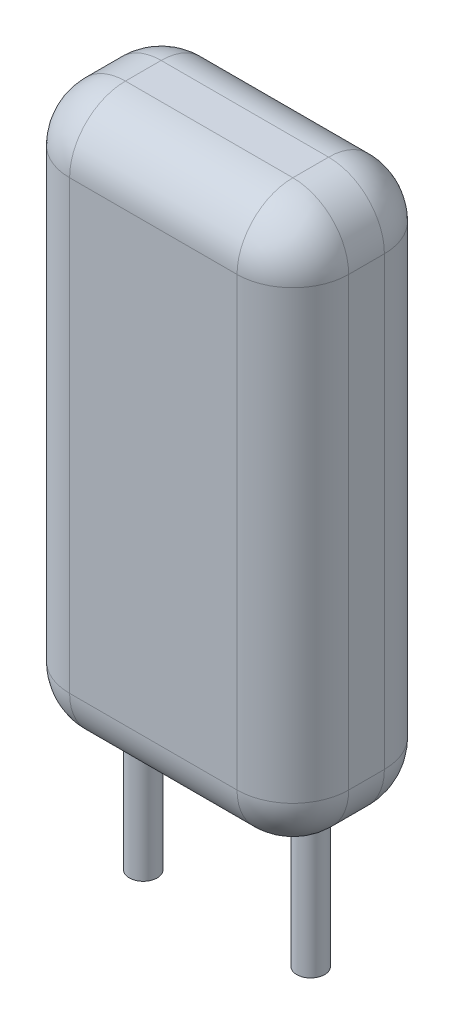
ISO-10303-21;
HEADER;
FILE_DESCRIPTION(('STEP AP214'),'2;1');
FILE_NAME('part.step','',(''),(''),'','','');
FILE_SCHEMA(('AUTOMOTIVE_DESIGN { 1 0 10303 214 1 1 1 1 }'));
ENDSEC;
DATA;
#1=APPLICATION_CONTEXT('core data for automotive mechanical design processes');
#2=APPLICATION_PROTOCOL_DEFINITION('international standard','automotive_design',2000,#1);
#3=PRODUCT_CONTEXT('',#1,'mechanical');
#4=PRODUCT('Part','Part','',(#3));
#5=PRODUCT_RELATED_PRODUCT_CATEGORY('part','',(#4));
#6=PRODUCT_DEFINITION_FORMATION('','',#4);
#7=PRODUCT_DEFINITION_CONTEXT('part definition',#1,'design');
#8=PRODUCT_DEFINITION('design','',#6,#7);
#9=PRODUCT_DEFINITION_SHAPE('','',#8);
#10=(LENGTH_UNIT() NAMED_UNIT(*) SI_UNIT(.MILLI.,.METRE.));
#11=(NAMED_UNIT(*) PLANE_ANGLE_UNIT() SI_UNIT($,.RADIAN.));
#12=(NAMED_UNIT(*) SI_UNIT($,.STERADIAN.) SOLID_ANGLE_UNIT());
#13=UNCERTAINTY_MEASURE_WITH_UNIT(LENGTH_MEASURE(1.E-05),#10,'distance_accuracy_value','');
#14=(GEOMETRIC_REPRESENTATION_CONTEXT(3) GLOBAL_UNCERTAINTY_ASSIGNED_CONTEXT((#13)) GLOBAL_UNIT_ASSIGNED_CONTEXT((#10,
#11,#12)) REPRESENTATION_CONTEXT('',''));
#15=CARTESIAN_POINT('',(0.,0.,0.));
#16=DIRECTION('',(0.,0.,1.));
#17=DIRECTION('',(1.,0.,0.));
#18=AXIS2_PLACEMENT_3D('',#15,#16,#17);
#19=CARTESIAN_POINT('',(5.,0.,1.32));
#20=DIRECTION('',(0.,1.,0.));
#21=DIRECTION('',(0.,0.,1.));
#22=AXIS2_PLACEMENT_3D('',#19,#20,#21);
#23=PLANE('',#22);
#24=CARTESIAN_POINT('',(1.,0.,0.));
#25=DIRECTION('',(0.,-1.,0.));
#26=DIRECTION('',(0.,0.,-1.));
#27=AXIS2_PLACEMENT_3D('',#24,#25,#26);
#28=CIRCLE('',#27,0.25);
#29=CARTESIAN_POINT('',(1.,0.,-0.25));
#30=VERTEX_POINT('',#29);
#31=CARTESIAN_POINT('',(1.,0.,0.25));
#32=VERTEX_POINT('',#31);
#33=EDGE_CURVE('E143',#30,#32,#28,.T.);
#34=ORIENTED_EDGE('',*,*,#33,.F.);
#35=DIRECTION('',(0.,0.,-1.));
#36=VECTOR('',#35,1.);
#37=CARTESIAN_POINT('',(1.,0.,-1.32));
#38=LINE('',#37,#36);
#39=CARTESIAN_POINT('',(1.,0.,-0.32));
#40=VERTEX_POINT('',#39);
#41=EDGE_CURVE('E129',#30,#40,#38,.T.);
#42=ORIENTED_EDGE('',*,*,#41,.T.);
#43=DIRECTION('',(-1.,0.,0.));
#44=VECTOR('',#43,1.);
#45=CARTESIAN_POINT('',(5.,0.,-0.32));
#46=LINE('',#45,#44);
#47=CARTESIAN_POINT('',(4.,0.,-0.32));
#48=VERTEX_POINT('',#47);
#49=EDGE_CURVE('E139',#40,#48,#46,.F.);
#50=ORIENTED_EDGE('',*,*,#49,.T.);
#51=DIRECTION('',(0.,0.,-1.));
#52=VECTOR('',#51,1.);
#53=CARTESIAN_POINT('',(4.,0.,1.32));
#54=LINE('',#53,#52);
#55=CARTESIAN_POINT('',(4.,0.,-0.25));
#56=VERTEX_POINT('',#55);
#57=EDGE_CURVE('E248',#48,#56,#54,.F.);
#58=ORIENTED_EDGE('',*,*,#57,.T.);
#59=CARTESIAN_POINT('',(4.,0.,0.));
#60=DIRECTION('',(0.,-1.,0.));
#61=DIRECTION('',(0.,0.,-1.));
#62=AXIS2_PLACEMENT_3D('',#59,#60,#61);
#63=CIRCLE('',#62,0.25);
#64=CARTESIAN_POINT('',(4.,0.,0.25));
#65=VERTEX_POINT('',#64);
#66=EDGE_CURVE('E156',#65,#56,#63,.T.);
#67=ORIENTED_EDGE('',*,*,#66,.F.);
#68=CARTESIAN_POINT('',(4.,0.,0.32));
#69=VERTEX_POINT('',#68);
#70=EDGE_CURVE('E247',#65,#69,#54,.F.);
#71=ORIENTED_EDGE('',*,*,#70,.T.);
#72=DIRECTION('',(-1.,0.,0.));
#73=VECTOR('',#72,1.);
#74=CARTESIAN_POINT('',(5.,0.,0.32));
#75=LINE('',#74,#73);
#76=CARTESIAN_POINT('',(1.,0.,0.32));
#77=VERTEX_POINT('',#76);
#78=EDGE_CURVE('E245',#69,#77,#75,.T.);
#79=ORIENTED_EDGE('',*,*,#78,.T.);
#80=EDGE_CURVE('E141',#77,#32,#38,.T.);
#81=ORIENTED_EDGE('',*,*,#80,.T.);
#82=EDGE_LOOP('',(#34,#42,#50,#58,#67,#71,#79,#81));
#83=FACE_BOUND('',#82,.T.);
#84=ADVANCED_FACE('F28',(#83),#23,.F.);
#85=CARTESIAN_POINT('',(5.,0.,1.32));
#86=DIRECTION('',(0.,0.,-1.));
#87=DIRECTION('',(-1.,0.,0.));
#88=AXIS2_PLACEMENT_3D('',#85,#86,#87);
#89=PLANE('',#88);
#90=DIRECTION('',(0.,-1.,0.));
#91=VECTOR('',#90,1.);
#92=CARTESIAN_POINT('',(1.,0.,1.32));
#93=LINE('',#92,#91);
#94=CARTESIAN_POINT('',(1.,9.,1.32));
#95=VERTEX_POINT('',#94);
#96=CARTESIAN_POINT('',(1.,1.,1.32));
#97=VERTEX_POINT('',#96);
#98=EDGE_CURVE('E262',#95,#97,#93,.T.);
#99=ORIENTED_EDGE('',*,*,#98,.T.);
#100=DIRECTION('',(-1.,0.,0.));
#101=VECTOR('',#100,1.);
#102=CARTESIAN_POINT('',(5.,1.,1.32));
#103=LINE('',#102,#101);
#104=CARTESIAN_POINT('',(4.,1.,1.32));
#105=VERTEX_POINT('',#104);
#106=EDGE_CURVE('E266',#97,#105,#103,.F.);
#107=ORIENTED_EDGE('',*,*,#106,.T.);
#108=DIRECTION('',(0.,-1.,0.));
#109=VECTOR('',#108,1.);
#110=CARTESIAN_POINT('',(4.,0.,1.32));
#111=LINE('',#110,#109);
#112=CARTESIAN_POINT('',(4.,9.,1.32));
#113=VERTEX_POINT('',#112);
#114=EDGE_CURVE('E264',#105,#113,#111,.F.);
#115=ORIENTED_EDGE('',*,*,#114,.T.);
#116=DIRECTION('',(-1.,0.,0.));
#117=VECTOR('',#116,1.);
#118=CARTESIAN_POINT('',(5.,9.,1.32));
#119=LINE('',#118,#117);
#120=EDGE_CURVE('E260',#113,#95,#119,.T.);
#121=ORIENTED_EDGE('',*,*,#120,.T.);
#122=EDGE_LOOP('',(#99,#107,#115,#121));
#123=FACE_BOUND('',#122,.T.);
#124=ADVANCED_FACE('F30',(#123),#89,.F.);
#125=CARTESIAN_POINT('',(5.,0.,-1.32));
#126=DIRECTION('',(0.,0.,1.));
#127=DIRECTION('',(1.,0.,0.));
#128=AXIS2_PLACEMENT_3D('',#125,#126,#127);
#129=PLANE('',#128);
#130=DIRECTION('',(-1.,0.,0.));
#131=VECTOR('',#130,1.);
#132=CARTESIAN_POINT('',(5.,1.,-1.32));
#133=LINE('',#132,#131);
#134=CARTESIAN_POINT('',(4.,1.,-1.32));
#135=VERTEX_POINT('',#134);
#136=CARTESIAN_POINT('',(1.,1.,-1.32));
#137=VERTEX_POINT('',#136);
#138=EDGE_CURVE('E231',#135,#137,#133,.T.);
#139=ORIENTED_EDGE('',*,*,#138,.T.);
#140=DIRECTION('',(0.,1.,0.));
#141=VECTOR('',#140,1.);
#142=CARTESIAN_POINT('',(1.,10.,-1.32));
#143=LINE('',#142,#141);
#144=CARTESIAN_POINT('',(1.,9.,-1.32));
#145=VERTEX_POINT('',#144);
#146=EDGE_CURVE('E233',#137,#145,#143,.T.);
#147=ORIENTED_EDGE('',*,*,#146,.T.);
#148=DIRECTION('',(-1.,0.,0.));
#149=VECTOR('',#148,1.);
#150=CARTESIAN_POINT('',(5.,9.,-1.32));
#151=LINE('',#150,#149);
#152=CARTESIAN_POINT('',(4.,9.,-1.32));
#153=VERTEX_POINT('',#152);
#154=EDGE_CURVE('E227',#145,#153,#151,.F.);
#155=ORIENTED_EDGE('',*,*,#154,.T.);
#156=DIRECTION('',(0.,1.,0.));
#157=VECTOR('',#156,1.);
#158=CARTESIAN_POINT('',(4.,0.,-1.32));
#159=LINE('',#158,#157);
#160=EDGE_CURVE('E229',#153,#135,#159,.F.);
#161=ORIENTED_EDGE('',*,*,#160,.T.);
#162=EDGE_LOOP('',(#139,#147,#155,#161));
#163=FACE_BOUND('',#162,.T.);
#164=ADVANCED_FACE('F328',(#163),#129,.F.);
#165=CARTESIAN_POINT('',(5.,10.,1.32));
#166=DIRECTION('',(0.,-1.,0.));
#167=DIRECTION('',(0.,0.,-1.));
#168=AXIS2_PLACEMENT_3D('',#165,#166,#167);
#169=PLANE('',#168);
#170=DIRECTION('',(-1.,0.,0.));
#171=VECTOR('',#170,1.);
#172=CARTESIAN_POINT('',(5.,10.,0.32));
#173=LINE('',#172,#171);
#174=CARTESIAN_POINT('',(1.,10.,0.32));
#175=VERTEX_POINT('',#174);
#176=CARTESIAN_POINT('',(4.,10.,0.32));
#177=VERTEX_POINT('',#176);
#178=EDGE_CURVE('E269',#175,#177,#173,.F.);
#179=ORIENTED_EDGE('',*,*,#178,.T.);
#180=DIRECTION('',(0.,0.,1.));
#181=VECTOR('',#180,1.);
#182=CARTESIAN_POINT('',(4.,10.,1.32));
#183=LINE('',#182,#181);
#184=CARTESIAN_POINT('',(4.,10.,-0.32));
#185=VERTEX_POINT('',#184);
#186=EDGE_CURVE('E11',#177,#185,#183,.F.);
#187=ORIENTED_EDGE('',*,*,#186,.T.);
#188=DIRECTION('',(-1.,0.,0.));
#189=VECTOR('',#188,1.);
#190=CARTESIAN_POINT('',(5.,10.,-0.32));
#191=LINE('',#190,#189);
#192=CARTESIAN_POINT('',(1.,10.,-0.32));
#193=VERTEX_POINT('',#192);
#194=EDGE_CURVE('E36',#185,#193,#191,.T.);
#195=ORIENTED_EDGE('',*,*,#194,.T.);
#196=DIRECTION('',(0.,0.,1.));
#197=VECTOR('',#196,1.);
#198=CARTESIAN_POINT('',(1.,10.,1.32));
#199=LINE('',#198,#197);
#200=EDGE_CURVE('E271',#193,#175,#199,.T.);
#201=ORIENTED_EDGE('',*,*,#200,.T.);
#202=EDGE_LOOP('',(#179,#187,#195,#201));
#203=FACE_BOUND('',#202,.T.);
#204=ADVANCED_FACE('F274',(#203),#169,.F.);
#205=CARTESIAN_POINT('',(5.,10.,1.32));
#206=DIRECTION('',(-1.,0.,0.));
#207=DIRECTION('',(0.,0.,1.));
#208=AXIS2_PLACEMENT_3D('',#205,#206,#207);
#209=PLANE('',#208);
#210=DIRECTION('',(0.,-1.,0.));
#211=VECTOR('',#210,1.);
#212=CARTESIAN_POINT('',(5.,10.,0.32));
#213=LINE('',#212,#211);
#214=CARTESIAN_POINT('',(5.,9.,0.32));
#215=VERTEX_POINT('',#214);
#216=CARTESIAN_POINT('',(5.,1.,0.32));
#217=VERTEX_POINT('',#216);
#218=EDGE_CURVE('E253',#215,#217,#213,.T.);
#219=ORIENTED_EDGE('',*,*,#218,.T.);
#220=DIRECTION('',(0.,0.,-1.));
#221=VECTOR('',#220,1.);
#222=CARTESIAN_POINT('',(5.,1.,1.32));
#223=LINE('',#222,#221);
#224=CARTESIAN_POINT('',(5.,1.,-0.32));
#225=VERTEX_POINT('',#224);
#226=EDGE_CURVE('E257',#217,#225,#223,.T.);
#227=ORIENTED_EDGE('',*,*,#226,.T.);
#228=DIRECTION('',(0.,1.,0.));
#229=VECTOR('',#228,1.);
#230=CARTESIAN_POINT('',(5.,10.,-0.32));
#231=LINE('',#230,#229);
#232=CARTESIAN_POINT('',(5.,9.,-0.32));
#233=VERTEX_POINT('',#232);
#234=EDGE_CURVE('E255',#225,#233,#231,.T.);
#235=ORIENTED_EDGE('',*,*,#234,.T.);
#236=DIRECTION('',(0.,0.,1.));
#237=VECTOR('',#236,1.);
#238=CARTESIAN_POINT('',(5.,9.,1.32));
#239=LINE('',#238,#237);
#240=EDGE_CURVE('E251',#233,#215,#239,.T.);
#241=ORIENTED_EDGE('',*,*,#240,.T.);
#242=EDGE_LOOP('',(#219,#227,#235,#241));
#243=FACE_BOUND('',#242,.T.);
#244=ADVANCED_FACE('F352',(#243),#209,.F.);
#245=CARTESIAN_POINT('',(0.,10.,1.32));
#246=DIRECTION('',(-1.,0.,0.));
#247=DIRECTION('',(0.,0.,1.));
#248=AXIS2_PLACEMENT_3D('',#245,#246,#247);
#249=PLANE('',#248);
#250=DIRECTION('',(0.,0.,1.));
#251=VECTOR('',#250,1.);
#252=CARTESIAN_POINT('',(0.,9.,-1.32));
#253=LINE('',#252,#251);
#254=CARTESIAN_POINT('',(0.,9.,0.32));
#255=VERTEX_POINT('',#254);
#256=CARTESIAN_POINT('',(0.,9.,-0.32));
#257=VERTEX_POINT('',#256);
#258=EDGE_CURVE('E238',#255,#257,#253,.F.);
#259=ORIENTED_EDGE('',*,*,#258,.T.);
#260=DIRECTION('',(0.,1.,0.));
#261=VECTOR('',#260,1.);
#262=CARTESIAN_POINT('',(0.,0.,-0.32));
#263=LINE('',#262,#261);
#264=CARTESIAN_POINT('',(0.,1.,-0.32));
#265=VERTEX_POINT('',#264);
#266=EDGE_CURVE('E242',#257,#265,#263,.F.);
#267=ORIENTED_EDGE('',*,*,#266,.T.);
#268=DIRECTION('',(0.,0.,-1.));
#269=VECTOR('',#268,1.);
#270=CARTESIAN_POINT('',(0.,1.,1.32));
#271=LINE('',#270,#269);
#272=CARTESIAN_POINT('',(0.,1.,0.32));
#273=VERTEX_POINT('',#272);
#274=EDGE_CURVE('E240',#265,#273,#271,.F.);
#275=ORIENTED_EDGE('',*,*,#274,.T.);
#276=DIRECTION('',(0.,-1.,0.));
#277=VECTOR('',#276,1.);
#278=CARTESIAN_POINT('',(0.,10.,0.32));
#279=LINE('',#278,#277);
#280=EDGE_CURVE('E236',#273,#255,#279,.F.);
#281=ORIENTED_EDGE('',*,*,#280,.T.);
#282=EDGE_LOOP('',(#259,#267,#275,#281));
#283=FACE_BOUND('',#282,.T.);
#284=ADVANCED_FACE('F296',(#283),#249,.T.);
#285=CARTESIAN_POINT('',(4.,10.,0.32));
#286=DIRECTION('',(0.,-1.,0.));
#287=DIRECTION('',(0.,0.,-1.));
#288=AXIS2_PLACEMENT_3D('',#285,#286,#287);
#289=CYLINDRICAL_SURFACE('',#288,1.);
#290=CARTESIAN_POINT('',(4.,1.,0.32));
#291=DIRECTION('',(0.,-1.,0.));
#292=DIRECTION('',(0.,0.,-1.));
#293=AXIS2_PLACEMENT_3D('',#290,#291,#292);
#294=CIRCLE('',#293,1.);
#295=EDGE_CURVE('E224',#217,#105,#294,.T.);
#296=ORIENTED_EDGE('',*,*,#295,.F.);
#297=ORIENTED_EDGE('',*,*,#218,.F.);
#298=CARTESIAN_POINT('',(4.,9.,0.32));
#299=DIRECTION('',(0.,1.,0.));
#300=DIRECTION('',(0.,0.,1.));
#301=AXIS2_PLACEMENT_3D('',#298,#299,#300);
#302=CIRCLE('',#301,1.);
#303=EDGE_CURVE('E221',#113,#215,#302,.T.);
#304=ORIENTED_EDGE('',*,*,#303,.F.);
#305=ORIENTED_EDGE('',*,*,#114,.F.);
#306=EDGE_LOOP('',(#296,#297,#304,#305));
#307=FACE_BOUND('',#306,.T.);
#308=ADVANCED_FACE('F349',(#307),#289,.T.);
#309=CARTESIAN_POINT('',(4.,1.,0.32));
#310=DIRECTION('',(0.,0.,1.));
#311=DIRECTION('',(1.,0.,0.));
#312=AXIS2_PLACEMENT_3D('',#309,#310,#311);
#313=SPHERICAL_SURFACE('',#312,1.);
#314=CARTESIAN_POINT('',(4.,1.,0.32));
#315=DIRECTION('',(0.,0.,1.));
#316=DIRECTION('',(1.,0.,0.));
#317=AXIS2_PLACEMENT_3D('',#314,#315,#316);
#318=CIRCLE('',#317,1.);
#319=EDGE_CURVE('E216',#217,#69,#318,.F.);
#320=ORIENTED_EDGE('',*,*,#319,.F.);
#321=ORIENTED_EDGE('',*,*,#295,.T.);
#322=CARTESIAN_POINT('',(4.,1.,0.32));
#323=DIRECTION('',(1.,0.,0.));
#324=DIRECTION('',(0.,0.,-1.));
#325=AXIS2_PLACEMENT_3D('',#322,#323,#324);
#326=CIRCLE('',#325,1.);
#327=EDGE_CURVE('E219',#69,#105,#326,.F.);
#328=ORIENTED_EDGE('',*,*,#327,.F.);
#329=EDGE_LOOP('',(#320,#321,#328));
#330=FACE_BOUND('',#329,.T.);
#331=ADVANCED_FACE('F383',(#330),#313,.T.);
#332=CARTESIAN_POINT('',(4.,9.,0.32));
#333=DIRECTION('',(0.,0.,1.));
#334=DIRECTION('',(1.,0.,0.));
#335=AXIS2_PLACEMENT_3D('',#332,#333,#334);
#336=SPHERICAL_SURFACE('',#335,1.);
#337=CARTESIAN_POINT('',(4.,9.,0.32));
#338=DIRECTION('',(1.,0.,0.));
#339=DIRECTION('',(0.,0.,-1.));
#340=AXIS2_PLACEMENT_3D('',#337,#338,#339);
#341=CIRCLE('',#340,1.);
#342=EDGE_CURVE('E210',#113,#177,#341,.F.);
#343=ORIENTED_EDGE('',*,*,#342,.F.);
#344=ORIENTED_EDGE('',*,*,#303,.T.);
#345=CARTESIAN_POINT('',(4.,9.,0.32));
#346=DIRECTION('',(0.,0.,1.));
#347=DIRECTION('',(1.,0.,0.));
#348=AXIS2_PLACEMENT_3D('',#345,#346,#347);
#349=CIRCLE('',#348,1.);
#350=EDGE_CURVE('E213',#177,#215,#349,.F.);
#351=ORIENTED_EDGE('',*,*,#350,.F.);
#352=EDGE_LOOP('',(#343,#344,#351));
#353=FACE_BOUND('',#352,.T.);
#354=ADVANCED_FACE('F312',(#353),#336,.T.);
#355=CARTESIAN_POINT('',(5.,1.,0.32));
#356=DIRECTION('',(-1.,0.,0.));
#357=DIRECTION('',(0.,0.,1.));
#358=AXIS2_PLACEMENT_3D('',#355,#356,#357);
#359=CYLINDRICAL_SURFACE('',#358,1.);
#360=ORIENTED_EDGE('',*,*,#327,.T.);
#361=ORIENTED_EDGE('',*,*,#106,.F.);
#362=CARTESIAN_POINT('',(1.,1.,0.32));
#363=DIRECTION('',(-1.,0.,0.));
#364=DIRECTION('',(0.,0.,1.));
#365=AXIS2_PLACEMENT_3D('',#362,#363,#364);
#366=CIRCLE('',#365,1.);
#367=EDGE_CURVE('E204',#77,#97,#366,.T.);
#368=ORIENTED_EDGE('',*,*,#367,.F.);
#369=ORIENTED_EDGE('',*,*,#78,.F.);
#370=EDGE_LOOP('',(#360,#361,#368,#369));
#371=FACE_BOUND('',#370,.T.);
#372=ADVANCED_FACE('F342',(#371),#359,.T.);
#373=CARTESIAN_POINT('',(4.,1.,1.32));
#374=DIRECTION('',(0.,0.,-1.));
#375=DIRECTION('',(-1.,0.,0.));
#376=AXIS2_PLACEMENT_3D('',#373,#374,#375);
#377=CYLINDRICAL_SURFACE('',#376,1.);
#378=ORIENTED_EDGE('',*,*,#319,.T.);
#379=ORIENTED_EDGE('',*,*,#70,.F.);
#380=EDGE_CURVE('E51',#56,#65,#54,.F.);
#381=ORIENTED_EDGE('',*,*,#380,.F.);
#382=ORIENTED_EDGE('',*,*,#57,.F.);
#383=CARTESIAN_POINT('',(4.,1.,-0.32));
#384=DIRECTION('',(0.,0.,-1.));
#385=DIRECTION('',(-1.,0.,0.));
#386=AXIS2_PLACEMENT_3D('',#383,#384,#385);
#387=CIRCLE('',#386,1.);
#388=EDGE_CURVE('E201',#225,#48,#387,.T.);
#389=ORIENTED_EDGE('',*,*,#388,.F.);
#390=ORIENTED_EDGE('',*,*,#226,.F.);
#391=EDGE_LOOP('',(#378,#379,#381,#382,#389,#390));
#392=FACE_BOUND('',#391,.T.);
#393=ADVANCED_FACE('F355',(#392),#377,.T.);
#394=CARTESIAN_POINT('',(4.,10.,-0.32));
#395=DIRECTION('',(0.,1.,0.));
#396=DIRECTION('',(0.,0.,1.));
#397=AXIS2_PLACEMENT_3D('',#394,#395,#396);
#398=CYLINDRICAL_SURFACE('',#397,1.);
#399=CARTESIAN_POINT('',(4.,9.,-0.32));
#400=DIRECTION('',(0.,1.,0.));
#401=DIRECTION('',(0.,0.,1.));
#402=AXIS2_PLACEMENT_3D('',#399,#400,#401);
#403=CIRCLE('',#402,1.);
#404=EDGE_CURVE('E196',#233,#153,#403,.T.);
#405=ORIENTED_EDGE('',*,*,#404,.F.);
#406=ORIENTED_EDGE('',*,*,#234,.F.);
#407=CARTESIAN_POINT('',(4.,1.,-0.32));
#408=DIRECTION('',(0.,-1.,0.));
#409=DIRECTION('',(1.,0.,0.));
#410=AXIS2_PLACEMENT_3D('',#407,#408,#409);
#411=CIRCLE('',#410,1.);
#412=EDGE_CURVE('E199',#135,#225,#411,.T.);
#413=ORIENTED_EDGE('',*,*,#412,.F.);
#414=ORIENTED_EDGE('',*,*,#160,.F.);
#415=EDGE_LOOP('',(#405,#406,#413,#414));
#416=FACE_BOUND('',#415,.T.);
#417=ADVANCED_FACE('F324',(#416),#398,.T.);
#418=CARTESIAN_POINT('',(4.,9.,1.32));
#419=DIRECTION('',(0.,0.,1.));
#420=DIRECTION('',(1.,0.,0.));
#421=AXIS2_PLACEMENT_3D('',#418,#419,#420);
#422=CYLINDRICAL_SURFACE('',#421,1.);
#423=ORIENTED_EDGE('',*,*,#350,.T.);
#424=ORIENTED_EDGE('',*,*,#240,.F.);
#425=CARTESIAN_POINT('',(4.,9.,-0.32));
#426=DIRECTION('',(0.,0.,-1.));
#427=DIRECTION('',(-1.,0.,0.));
#428=AXIS2_PLACEMENT_3D('',#425,#426,#427);
#429=CIRCLE('',#428,1.);
#430=EDGE_CURVE('E193',#185,#233,#429,.T.);
#431=ORIENTED_EDGE('',*,*,#430,.F.);
#432=ORIENTED_EDGE('',*,*,#186,.F.);
#433=EDGE_LOOP('',(#423,#424,#431,#432));
#434=FACE_BOUND('',#433,.T.);
#435=ADVANCED_FACE('F317',(#434),#422,.T.);
#436=CARTESIAN_POINT('',(5.,9.,0.32));
#437=DIRECTION('',(-1.,0.,0.));
#438=DIRECTION('',(0.,0.,1.));
#439=AXIS2_PLACEMENT_3D('',#436,#437,#438);
#440=CYLINDRICAL_SURFACE('',#439,1.);
#441=ORIENTED_EDGE('',*,*,#342,.T.);
#442=ORIENTED_EDGE('',*,*,#178,.F.);
#443=CARTESIAN_POINT('',(1.,9.,0.32));
#444=DIRECTION('',(-1.,0.,0.));
#445=DIRECTION('',(0.,0.,1.));
#446=AXIS2_PLACEMENT_3D('',#443,#444,#445);
#447=CIRCLE('',#446,1.);
#448=EDGE_CURVE('E190',#95,#175,#447,.T.);
#449=ORIENTED_EDGE('',*,*,#448,.F.);
#450=ORIENTED_EDGE('',*,*,#120,.F.);
#451=EDGE_LOOP('',(#441,#442,#449,#450));
#452=FACE_BOUND('',#451,.T.);
#453=ADVANCED_FACE('F308',(#452),#440,.T.);
#454=CARTESIAN_POINT('',(1.,0.,0.32));
#455=DIRECTION('',(0.,1.,0.));
#456=DIRECTION('',(0.,0.,1.));
#457=AXIS2_PLACEMENT_3D('',#454,#455,#456);
#458=CYLINDRICAL_SURFACE('',#457,1.);
#459=CARTESIAN_POINT('',(1.,1.,0.32));
#460=DIRECTION('',(0.,-1.,0.));
#461=DIRECTION('',(0.,0.,-1.));
#462=AXIS2_PLACEMENT_3D('',#459,#460,#461);
#463=CIRCLE('',#462,1.);
#464=EDGE_CURVE('E207',#97,#273,#463,.T.);
#465=ORIENTED_EDGE('',*,*,#464,.F.);
#466=ORIENTED_EDGE('',*,*,#98,.F.);
#467=CARTESIAN_POINT('',(1.,9.,0.32));
#468=DIRECTION('',(0.,1.,0.));
#469=DIRECTION('',(0.,0.,1.));
#470=AXIS2_PLACEMENT_3D('',#467,#468,#469);
#471=CIRCLE('',#470,1.);
#472=EDGE_CURVE('E187',#255,#95,#471,.T.);
#473=ORIENTED_EDGE('',*,*,#472,.F.);
#474=ORIENTED_EDGE('',*,*,#280,.F.);
#475=EDGE_LOOP('',(#465,#466,#473,#474));
#476=FACE_BOUND('',#475,.T.);
#477=ADVANCED_FACE('F302',(#476),#458,.T.);
#478=CARTESIAN_POINT('',(1.,1.,0.32));
#479=DIRECTION('',(0.,0.,1.));
#480=DIRECTION('',(1.,0.,0.));
#481=AXIS2_PLACEMENT_3D('',#478,#479,#480);
#482=SPHERICAL_SURFACE('',#481,1.);
#483=ORIENTED_EDGE('',*,*,#367,.T.);
#484=ORIENTED_EDGE('',*,*,#464,.T.);
#485=CARTESIAN_POINT('',(1.,1.,0.32));
#486=DIRECTION('',(0.,0.,1.));
#487=DIRECTION('',(1.,0.,0.));
#488=AXIS2_PLACEMENT_3D('',#485,#486,#487);
#489=CIRCLE('',#488,1.);
#490=EDGE_CURVE('E185',#77,#273,#489,.F.);
#491=ORIENTED_EDGE('',*,*,#490,.F.);
#492=EDGE_LOOP('',(#483,#484,#491));
#493=FACE_BOUND('',#492,.T.);
#494=ADVANCED_FACE('F337',(#493),#482,.T.);
#495=CARTESIAN_POINT('',(4.,1.,-0.32));
#496=DIRECTION('',(0.,0.,1.));
#497=DIRECTION('',(1.,0.,0.));
#498=AXIS2_PLACEMENT_3D('',#495,#496,#497);
#499=SPHERICAL_SURFACE('',#498,1.);
#500=ORIENTED_EDGE('',*,*,#412,.T.);
#501=ORIENTED_EDGE('',*,*,#388,.T.);
#502=CARTESIAN_POINT('',(4.,1.,-0.32));
#503=DIRECTION('',(1.,0.,0.));
#504=DIRECTION('',(0.,0.,-1.));
#505=AXIS2_PLACEMENT_3D('',#502,#503,#504);
#506=CIRCLE('',#505,1.);
#507=EDGE_CURVE('E182',#135,#48,#506,.F.);
#508=ORIENTED_EDGE('',*,*,#507,.F.);
#509=EDGE_LOOP('',(#500,#501,#508));
#510=FACE_BOUND('',#509,.T.);
#511=ADVANCED_FACE('F357',(#510),#499,.T.);
#512=CARTESIAN_POINT('',(4.,9.,-0.32));
#513=DIRECTION('',(0.,0.,1.));
#514=DIRECTION('',(1.,0.,0.));
#515=AXIS2_PLACEMENT_3D('',#512,#513,#514);
#516=SPHERICAL_SURFACE('',#515,1.);
#517=ORIENTED_EDGE('',*,*,#430,.T.);
#518=ORIENTED_EDGE('',*,*,#404,.T.);
#519=CARTESIAN_POINT('',(4.,9.,-0.32));
#520=DIRECTION('',(1.,0.,0.));
#521=DIRECTION('',(0.,0.,-1.));
#522=AXIS2_PLACEMENT_3D('',#519,#520,#521);
#523=CIRCLE('',#522,1.);
#524=EDGE_CURVE('E179',#185,#153,#523,.F.);
#525=ORIENTED_EDGE('',*,*,#524,.F.);
#526=EDGE_LOOP('',(#517,#518,#525));
#527=FACE_BOUND('',#526,.T.);
#528=ADVANCED_FACE('F320',(#527),#516,.T.);
#529=CARTESIAN_POINT('',(1.,9.,0.32));
#530=DIRECTION('',(0.,0.,1.));
#531=DIRECTION('',(1.,0.,0.));
#532=AXIS2_PLACEMENT_3D('',#529,#530,#531);
#533=SPHERICAL_SURFACE('',#532,1.);
#534=ORIENTED_EDGE('',*,*,#472,.T.);
#535=ORIENTED_EDGE('',*,*,#448,.T.);
#536=CARTESIAN_POINT('',(1.,9.,0.32));
#537=DIRECTION('',(0.,0.,1.));
#538=DIRECTION('',(1.,0.,0.));
#539=AXIS2_PLACEMENT_3D('',#536,#537,#538);
#540=CIRCLE('',#539,1.);
#541=EDGE_CURVE('E176',#255,#175,#540,.F.);
#542=ORIENTED_EDGE('',*,*,#541,.F.);
#543=EDGE_LOOP('',(#534,#535,#542));
#544=FACE_BOUND('',#543,.T.);
#545=ADVANCED_FACE('F305',(#544),#533,.T.);
#546=CARTESIAN_POINT('',(1.,1.,1.32));
#547=DIRECTION('',(0.,0.,1.));
#548=DIRECTION('',(1.,0.,0.));
#549=AXIS2_PLACEMENT_3D('',#546,#547,#548);
#550=CYLINDRICAL_SURFACE('',#549,1.);
#551=ORIENTED_EDGE('',*,*,#490,.T.);
#552=ORIENTED_EDGE('',*,*,#274,.F.);
#553=CARTESIAN_POINT('',(1.,1.,-0.32));
#554=DIRECTION('',(0.,0.,-1.));
#555=DIRECTION('',(-1.,0.,0.));
#556=AXIS2_PLACEMENT_3D('',#553,#554,#555);
#557=CIRCLE('',#556,1.);
#558=EDGE_CURVE('E135',#40,#265,#557,.T.);
#559=ORIENTED_EDGE('',*,*,#558,.F.);
#560=ORIENTED_EDGE('',*,*,#41,.F.);
#561=EDGE_CURVE('E43',#32,#30,#38,.T.);
#562=ORIENTED_EDGE('',*,*,#561,.F.);
#563=ORIENTED_EDGE('',*,*,#80,.F.);
#564=EDGE_LOOP('',(#551,#552,#559,#560,#562,#563));
#565=FACE_BOUND('',#564,.T.);
#566=ADVANCED_FACE('F132',(#565),#550,.T.);
#567=CARTESIAN_POINT('',(5.,1.,-0.32));
#568=DIRECTION('',(-1.,0.,0.));
#569=DIRECTION('',(0.,0.,1.));
#570=AXIS2_PLACEMENT_3D('',#567,#568,#569);
#571=CYLINDRICAL_SURFACE('',#570,1.);
#572=ORIENTED_EDGE('',*,*,#507,.T.);
#573=ORIENTED_EDGE('',*,*,#49,.F.);
#574=CARTESIAN_POINT('',(1.,1.,-0.32));
#575=DIRECTION('',(-1.,0.,0.));
#576=DIRECTION('',(0.,0.,1.));
#577=AXIS2_PLACEMENT_3D('',#574,#575,#576);
#578=CIRCLE('',#577,1.);
#579=EDGE_CURVE('E173',#137,#40,#578,.T.);
#580=ORIENTED_EDGE('',*,*,#579,.F.);
#581=ORIENTED_EDGE('',*,*,#138,.F.);
#582=EDGE_LOOP('',(#572,#573,#580,#581));
#583=FACE_BOUND('',#582,.T.);
#584=ADVANCED_FACE('F332',(#583),#571,.T.);
#585=CARTESIAN_POINT('',(5.,9.,-0.32));
#586=DIRECTION('',(-1.,0.,0.));
#587=DIRECTION('',(0.,0.,1.));
#588=AXIS2_PLACEMENT_3D('',#585,#586,#587);
#589=CYLINDRICAL_SURFACE('',#588,1.);
#590=ORIENTED_EDGE('',*,*,#524,.T.);
#591=ORIENTED_EDGE('',*,*,#154,.F.);
#592=CARTESIAN_POINT('',(1.,9.,-0.32));
#593=DIRECTION('',(-1.,0.,0.));
#594=DIRECTION('',(0.,0.,1.));
#595=AXIS2_PLACEMENT_3D('',#592,#593,#594);
#596=CIRCLE('',#595,1.);
#597=EDGE_CURVE('E170',#193,#145,#596,.T.);
#598=ORIENTED_EDGE('',*,*,#597,.F.);
#599=ORIENTED_EDGE('',*,*,#194,.F.);
#600=EDGE_LOOP('',(#590,#591,#598,#599));
#601=FACE_BOUND('',#600,.T.);
#602=ADVANCED_FACE('F287',(#601),#589,.T.);
#603=CARTESIAN_POINT('',(1.,9.,1.32));
#604=DIRECTION('',(0.,0.,-1.));
#605=DIRECTION('',(-1.,0.,0.));
#606=AXIS2_PLACEMENT_3D('',#603,#604,#605);
#607=CYLINDRICAL_SURFACE('',#606,1.);
#608=ORIENTED_EDGE('',*,*,#541,.T.);
#609=ORIENTED_EDGE('',*,*,#200,.F.);
#610=CARTESIAN_POINT('',(1.,9.,-0.32));
#611=DIRECTION('',(0.,0.,-1.));
#612=DIRECTION('',(-1.,0.,0.));
#613=AXIS2_PLACEMENT_3D('',#610,#611,#612);
#614=CIRCLE('',#613,1.);
#615=EDGE_CURVE('E167',#257,#193,#614,.T.);
#616=ORIENTED_EDGE('',*,*,#615,.F.);
#617=ORIENTED_EDGE('',*,*,#258,.F.);
#618=EDGE_LOOP('',(#608,#609,#616,#617));
#619=FACE_BOUND('',#618,.T.);
#620=ADVANCED_FACE('F282',(#619),#607,.T.);
#621=CARTESIAN_POINT('',(1.,1.,-0.32));
#622=DIRECTION('',(0.,0.,1.));
#623=DIRECTION('',(1.,0.,0.));
#624=AXIS2_PLACEMENT_3D('',#621,#622,#623);
#625=SPHERICAL_SURFACE('',#624,1.);
#626=ORIENTED_EDGE('',*,*,#579,.T.);
#627=ORIENTED_EDGE('',*,*,#558,.T.);
#628=CARTESIAN_POINT('',(1.,1.,-0.32));
#629=DIRECTION('',(0.,-1.,0.));
#630=DIRECTION('',(0.,0.,-1.));
#631=AXIS2_PLACEMENT_3D('',#628,#629,#630);
#632=CIRCLE('',#631,1.);
#633=EDGE_CURVE('E165',#137,#265,#632,.F.);
#634=ORIENTED_EDGE('',*,*,#633,.F.);
#635=EDGE_LOOP('',(#626,#627,#634));
#636=FACE_BOUND('',#635,.T.);
#637=ADVANCED_FACE('F334',(#636),#625,.T.);
#638=CARTESIAN_POINT('',(1.,9.,-0.32));
#639=DIRECTION('',(0.,0.,1.));
#640=DIRECTION('',(1.,0.,0.));
#641=AXIS2_PLACEMENT_3D('',#638,#639,#640);
#642=SPHERICAL_SURFACE('',#641,1.);
#643=ORIENTED_EDGE('',*,*,#615,.T.);
#644=ORIENTED_EDGE('',*,*,#597,.T.);
#645=CARTESIAN_POINT('',(1.,9.,-0.32));
#646=DIRECTION('',(0.,1.,0.));
#647=DIRECTION('',(0.,0.,1.));
#648=AXIS2_PLACEMENT_3D('',#645,#646,#647);
#649=CIRCLE('',#648,1.);
#650=EDGE_CURVE('E163',#257,#145,#649,.F.);
#651=ORIENTED_EDGE('',*,*,#650,.F.);
#652=EDGE_LOOP('',(#643,#644,#651));
#653=FACE_BOUND('',#652,.T.);
#654=ADVANCED_FACE('F290',(#653),#642,.T.);
#655=CARTESIAN_POINT('',(1.,0.,-0.32));
#656=DIRECTION('',(0.,-1.,0.));
#657=DIRECTION('',(0.,0.,-1.));
#658=AXIS2_PLACEMENT_3D('',#655,#656,#657);
#659=CYLINDRICAL_SURFACE('',#658,1.);
#660=ORIENTED_EDGE('',*,*,#633,.T.);
#661=ORIENTED_EDGE('',*,*,#266,.F.);
#662=ORIENTED_EDGE('',*,*,#650,.T.);
#663=ORIENTED_EDGE('',*,*,#146,.F.);
#664=EDGE_LOOP('',(#660,#661,#662,#663));
#665=FACE_BOUND('',#664,.T.);
#666=ADVANCED_FACE('F293',(#665),#659,.T.);
#667=CARTESIAN_POINT('',(4.,0.,0.));
#668=DIRECTION('',(0.,-1.,0.));
#669=DIRECTION('',(0.,0.,-1.));
#670=AXIS2_PLACEMENT_3D('',#667,#668,#669);
#671=PLANE('',#670);
#672=EDGE_CURVE('E157',#56,#65,#63,.T.);
#673=ORIENTED_EDGE('',*,*,#672,.F.);
#674=ORIENTED_EDGE('',*,*,#380,.T.);
#675=EDGE_LOOP('',(#673,#674));
#676=FACE_BOUND('',#675,.T.);
#677=ADVANCED_FACE('F461',(#676),#671,.F.);
#678=CARTESIAN_POINT('',(4.,-2.4,0.));
#679=DIRECTION('',(0.,1.,0.));
#680=DIRECTION('',(0.,0.,1.));
#681=AXIS2_PLACEMENT_3D('',#678,#679,#680);
#682=CYLINDRICAL_SURFACE('',#681,0.25);
#683=CARTESIAN_POINT('',(4.,-2.4,0.));
#684=DIRECTION('',(0.,-1.,0.));
#685=DIRECTION('',(0.,0.,-1.));
#686=AXIS2_PLACEMENT_3D('',#683,#684,#685);
#687=CIRCLE('',#686,0.25);
#688=CARTESIAN_POINT('',(4.,-2.4,-0.25));
#689=VERTEX_POINT('',#688);
#690=EDGE_CURVE('E160',#689,#689,#687,.T.);
#691=ORIENTED_EDGE('',*,*,#690,.F.);
#692=EDGE_LOOP('',(#691));
#693=FACE_BOUND('',#692,.T.);
#694=ORIENTED_EDGE('',*,*,#672,.T.);
#695=ORIENTED_EDGE('',*,*,#66,.T.);
#696=EDGE_LOOP('',(#694,#695));
#697=FACE_BOUND('',#696,.T.);
#698=ADVANCED_FACE('F470',(#693,#697),#682,.T.);
#699=CARTESIAN_POINT('',(4.,-2.4,0.));
#700=DIRECTION('',(0.,-1.,0.));
#701=DIRECTION('',(0.,0.,-1.));
#702=AXIS2_PLACEMENT_3D('',#699,#700,#701);
#703=PLANE('',#702);
#704=ORIENTED_EDGE('',*,*,#690,.T.);
#705=EDGE_LOOP('',(#704));
#706=FACE_BOUND('',#705,.T.);
#707=ADVANCED_FACE('F478',(#706),#703,.T.);
#708=CARTESIAN_POINT('',(1.,0.,0.));
#709=DIRECTION('',(0.,-1.,0.));
#710=DIRECTION('',(0.,0.,-1.));
#711=AXIS2_PLACEMENT_3D('',#708,#709,#710);
#712=PLANE('',#711);
#713=EDGE_CURVE('E148',#32,#30,#28,.T.);
#714=ORIENTED_EDGE('',*,*,#713,.F.);
#715=ORIENTED_EDGE('',*,*,#561,.T.);
#716=EDGE_LOOP('',(#714,#715));
#717=FACE_BOUND('',#716,.T.);
#718=ADVANCED_FACE('F151',(#717),#712,.F.);
#719=CARTESIAN_POINT('',(1.,-2.4,0.));
#720=DIRECTION('',(0.,1.,0.));
#721=DIRECTION('',(0.,0.,1.));
#722=AXIS2_PLACEMENT_3D('',#719,#720,#721);
#723=CYLINDRICAL_SURFACE('',#722,0.25);
#724=CARTESIAN_POINT('',(1.,-2.4,0.));
#725=DIRECTION('',(0.,-1.,0.));
#726=DIRECTION('',(0.,0.,-1.));
#727=AXIS2_PLACEMENT_3D('',#724,#725,#726);
#728=CIRCLE('',#727,0.25);
#729=CARTESIAN_POINT('',(1.,-2.4,-0.25));
#730=VERTEX_POINT('',#729);
#731=EDGE_CURVE('E147',#730,#730,#728,.T.);
#732=ORIENTED_EDGE('',*,*,#731,.F.);
#733=EDGE_LOOP('',(#732));
#734=FACE_BOUND('',#733,.T.);
#735=ORIENTED_EDGE('',*,*,#33,.T.);
#736=ORIENTED_EDGE('',*,*,#713,.T.);
#737=EDGE_LOOP('',(#735,#736));
#738=FACE_BOUND('',#737,.T.);
#739=ADVANCED_FACE('F152',(#734,#738),#723,.T.);
#740=CARTESIAN_POINT('',(1.,-2.4,0.));
#741=DIRECTION('',(0.,-1.,0.));
#742=DIRECTION('',(0.,0.,-1.));
#743=AXIS2_PLACEMENT_3D('',#740,#741,#742);
#744=PLANE('',#743);
#745=ORIENTED_EDGE('',*,*,#731,.T.);
#746=EDGE_LOOP('',(#745));
#747=FACE_BOUND('',#746,.T.);
#748=ADVANCED_FACE('F499',(#747),#744,.T.);
#749=CLOSED_SHELL('',(#84,#124,#164,#204,#244,#284,#308,#331,#354,#372,#393,#417,#435,#453,#477,
#494,#511,#528,#545,#566,#584,#602,#620,#637,#654,#666,#677,#698,#707,#718,#739,#748));
#750=MANIFOLD_SOLID_BREP('B2',#749);
#751=ADVANCED_BREP_SHAPE_REPRESENTATION('',(#18,#750),#14);
#752=SHAPE_DEFINITION_REPRESENTATION(#9,#751);
ENDSEC;
END-ISO-10303-21;
